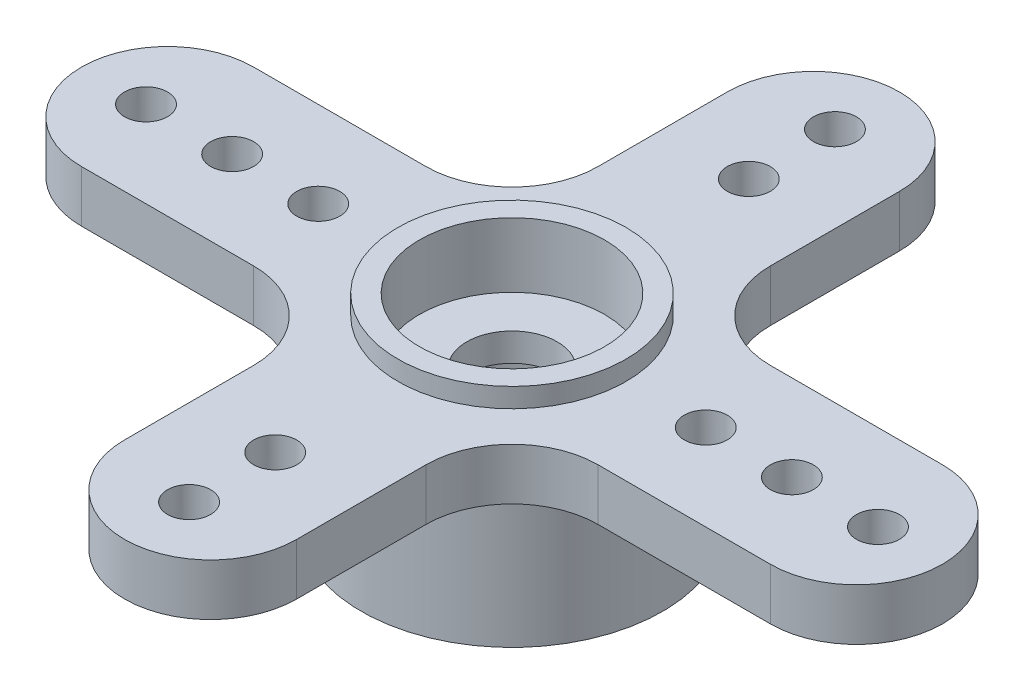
ISO-10303-21;
HEADER;
FILE_DESCRIPTION(('STEP AP214'),'2;1');
FILE_NAME('part.step','',(''),(''),'','','');
FILE_SCHEMA(('AUTOMOTIVE_DESIGN { 1 0 10303 214 1 1 1 1 }'));
ENDSEC;
DATA;
#1=APPLICATION_CONTEXT('core data for automotive mechanical design processes');
#2=APPLICATION_PROTOCOL_DEFINITION('international standard','automotive_design',2000,#1);
#3=PRODUCT_CONTEXT('',#1,'mechanical');
#4=PRODUCT('Part','Part','',(#3));
#5=PRODUCT_RELATED_PRODUCT_CATEGORY('part','',(#4));
#6=PRODUCT_DEFINITION_FORMATION('','',#4);
#7=PRODUCT_DEFINITION_CONTEXT('part definition',#1,'design');
#8=PRODUCT_DEFINITION('design','',#6,#7);
#9=PRODUCT_DEFINITION_SHAPE('','',#8);
#10=(LENGTH_UNIT() NAMED_UNIT(*) SI_UNIT(.MILLI.,.METRE.));
#11=(NAMED_UNIT(*) PLANE_ANGLE_UNIT() SI_UNIT($,.RADIAN.));
#12=(NAMED_UNIT(*) SI_UNIT($,.STERADIAN.) SOLID_ANGLE_UNIT());
#13=UNCERTAINTY_MEASURE_WITH_UNIT(LENGTH_MEASURE(1.E-05),#10,'distance_accuracy_value','');
#14=(GEOMETRIC_REPRESENTATION_CONTEXT(3) GLOBAL_UNCERTAINTY_ASSIGNED_CONTEXT((#13)) GLOBAL_UNIT_ASSIGNED_CONTEXT((#10,
#11,#12)) REPRESENTATION_CONTEXT('',''));
#15=CARTESIAN_POINT('',(0.,0.,0.));
#16=DIRECTION('',(0.,0.,1.));
#17=DIRECTION('',(1.,0.,0.));
#18=AXIS2_PLACEMENT_3D('',#15,#16,#17);
#19=CARTESIAN_POINT('',(3.5,0.500000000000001,0.));
#20=DIRECTION('',(0.,-1.,0.));
#21=DIRECTION('',(0.,0.,-1.));
#22=AXIS2_PLACEMENT_3D('',#19,#20,#21);
#23=PLANE('',#22);
#24=CARTESIAN_POINT('',(0.,0.5,0.));
#25=DIRECTION('',(0.,-1.,0.));
#26=DIRECTION('',(0.,0.,-1.));
#27=AXIS2_PLACEMENT_3D('',#24,#25,#26);
#28=CIRCLE('',#27,3.5);
#29=CARTESIAN_POINT('',(0.,0.5,-3.5));
#30=VERTEX_POINT('',#29);
#31=EDGE_CURVE('E205',#30,#30,#28,.T.);
#32=ORIENTED_EDGE('',*,*,#31,.F.);
#33=EDGE_LOOP('',(#32));
#34=FACE_BOUND('',#33,.T.);
#35=CARTESIAN_POINT('',(-6.5,0.500000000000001,0.));
#36=DIRECTION('',(0.,-1.,0.));
#37=DIRECTION('',(0.,0.,-1.));
#38=AXIS2_PLACEMENT_3D('',#35,#36,#37);
#39=CIRCLE('',#38,0.499999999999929);
#40=CARTESIAN_POINT('',(-6.5,0.500000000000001,-0.499999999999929));
#41=VERTEX_POINT('',#40);
#42=EDGE_CURVE('E229',#41,#41,#39,.T.);
#43=ORIENTED_EDGE('',*,*,#42,.F.);
#44=EDGE_LOOP('',(#43));
#45=FACE_BOUND('',#44,.T.);
#46=CARTESIAN_POINT('',(-4.5,0.500000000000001,0.));
#47=DIRECTION('',(0.,-1.,0.));
#48=DIRECTION('',(0.,0.,-1.));
#49=AXIS2_PLACEMENT_3D('',#46,#47,#48);
#50=CIRCLE('',#49,0.499999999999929);
#51=CARTESIAN_POINT('',(-4.5,0.500000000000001,-0.499999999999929));
#52=VERTEX_POINT('',#51);
#53=EDGE_CURVE('E235',#52,#52,#50,.T.);
#54=ORIENTED_EDGE('',*,*,#53,.F.);
#55=EDGE_LOOP('',(#54));
#56=FACE_BOUND('',#55,.T.);
#57=CARTESIAN_POINT('',(-8.5,0.500000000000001,0.));
#58=DIRECTION('',(0.,-1.,0.));
#59=DIRECTION('',(0.,0.,-1.));
#60=AXIS2_PLACEMENT_3D('',#57,#58,#59);
#61=CIRCLE('',#60,0.499999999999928);
#62=CARTESIAN_POINT('',(-8.5,0.500000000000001,-0.499999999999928));
#63=VERTEX_POINT('',#62);
#64=EDGE_CURVE('E241',#63,#63,#61,.T.);
#65=ORIENTED_EDGE('',*,*,#64,.F.);
#66=EDGE_LOOP('',(#65));
#67=FACE_BOUND('',#66,.T.);
#68=CARTESIAN_POINT('',(6.5,0.500000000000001,0.));
#69=DIRECTION('',(0.,-1.,0.));
#70=DIRECTION('',(0.,0.,-1.));
#71=AXIS2_PLACEMENT_3D('',#68,#69,#70);
#72=CIRCLE('',#71,0.499999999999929);
#73=CARTESIAN_POINT('',(6.5,0.500000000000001,-0.499999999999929));
#74=VERTEX_POINT('',#73);
#75=EDGE_CURVE('E247',#74,#74,#72,.T.);
#76=ORIENTED_EDGE('',*,*,#75,.F.);
#77=EDGE_LOOP('',(#76));
#78=FACE_BOUND('',#77,.T.);
#79=CARTESIAN_POINT('',(4.5,0.500000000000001,0.));
#80=DIRECTION('',(0.,-1.,0.));
#81=DIRECTION('',(0.,0.,-1.));
#82=AXIS2_PLACEMENT_3D('',#79,#80,#81);
#83=CIRCLE('',#82,0.499999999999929);
#84=CARTESIAN_POINT('',(4.5,0.500000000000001,-0.499999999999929));
#85=VERTEX_POINT('',#84);
#86=EDGE_CURVE('E253',#85,#85,#83,.T.);
#87=ORIENTED_EDGE('',*,*,#86,.F.);
#88=EDGE_LOOP('',(#87));
#89=FACE_BOUND('',#88,.T.);
#90=CARTESIAN_POINT('',(8.5,0.500000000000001,0.));
#91=DIRECTION('',(0.,-1.,0.));
#92=DIRECTION('',(0.,0.,-1.));
#93=AXIS2_PLACEMENT_3D('',#90,#91,#92);
#94=CIRCLE('',#93,0.499999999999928);
#95=CARTESIAN_POINT('',(8.5,0.500000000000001,-0.499999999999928));
#96=VERTEX_POINT('',#95);
#97=EDGE_CURVE('E259',#96,#96,#94,.T.);
#98=ORIENTED_EDGE('',*,*,#97,.F.);
#99=EDGE_LOOP('',(#98));
#100=FACE_BOUND('',#99,.T.);
#101=CARTESIAN_POINT('',(0.,0.500000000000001,-7.5));
#102=DIRECTION('',(0.,-1.,0.));
#103=DIRECTION('',(0.,0.,-1.));
#104=AXIS2_PLACEMENT_3D('',#101,#102,#103);
#105=CIRCLE('',#104,0.499999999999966);
#106=CARTESIAN_POINT('',(0.,0.500000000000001,-7.99999999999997));
#107=VERTEX_POINT('',#106);
#108=EDGE_CURVE('E265',#107,#107,#105,.T.);
#109=ORIENTED_EDGE('',*,*,#108,.F.);
#110=EDGE_LOOP('',(#109));
#111=FACE_BOUND('',#110,.T.);
#112=CARTESIAN_POINT('',(0.,0.500000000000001,-5.5));
#113=DIRECTION('',(0.,-1.,0.));
#114=DIRECTION('',(0.,0.,-1.));
#115=AXIS2_PLACEMENT_3D('',#112,#113,#114);
#116=CIRCLE('',#115,0.499999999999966);
#117=CARTESIAN_POINT('',(0.,0.500000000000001,-5.99999999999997));
#118=VERTEX_POINT('',#117);
#119=EDGE_CURVE('E271',#118,#118,#116,.T.);
#120=ORIENTED_EDGE('',*,*,#119,.F.);
#121=EDGE_LOOP('',(#120));
#122=FACE_BOUND('',#121,.T.);
#123=CARTESIAN_POINT('',(0.,0.500000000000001,7.5));
#124=DIRECTION('',(0.,-1.,0.));
#125=DIRECTION('',(0.,0.,-1.));
#126=AXIS2_PLACEMENT_3D('',#123,#124,#125);
#127=CIRCLE('',#126,0.499999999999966);
#128=CARTESIAN_POINT('',(0.,0.500000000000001,7.00000000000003));
#129=VERTEX_POINT('',#128);
#130=EDGE_CURVE('E277',#129,#129,#127,.T.);
#131=ORIENTED_EDGE('',*,*,#130,.F.);
#132=EDGE_LOOP('',(#131));
#133=FACE_BOUND('',#132,.T.);
#134=CARTESIAN_POINT('',(0.,0.500000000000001,5.5));
#135=DIRECTION('',(0.,-1.,0.));
#136=DIRECTION('',(0.,0.,-1.));
#137=AXIS2_PLACEMENT_3D('',#134,#135,#136);
#138=CIRCLE('',#137,0.499999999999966);
#139=CARTESIAN_POINT('',(0.,0.500000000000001,5.00000000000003));
#140=VERTEX_POINT('',#139);
#141=EDGE_CURVE('E283',#140,#140,#138,.T.);
#142=ORIENTED_EDGE('',*,*,#141,.F.);
#143=EDGE_LOOP('',(#142));
#144=FACE_BOUND('',#143,.T.);
#145=DIRECTION('',(-1.,0.,0.));
#146=VECTOR('',#145,1.);
#147=CARTESIAN_POINT('',(3.5,0.500000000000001,2.));
#148=LINE('',#147,#146);
#149=CARTESIAN_POINT('',(8.,0.5,2.));
#150=VERTEX_POINT('',#149);
#151=CARTESIAN_POINT('',(4.,0.500000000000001,2.));
#152=VERTEX_POINT('',#151);
#153=EDGE_CURVE('E332',#150,#152,#148,.T.);
#154=ORIENTED_EDGE('',*,*,#153,.T.);
#155=CARTESIAN_POINT('',(4.,0.5,4.));
#156=DIRECTION('',(0.,-1.,0.));
#157=DIRECTION('',(0.,0.,-1.));
#158=AXIS2_PLACEMENT_3D('',#155,#156,#157);
#159=CIRCLE('',#158,2.);
#160=CARTESIAN_POINT('',(2.,0.5,4.));
#161=VERTEX_POINT('',#160);
#162=EDGE_CURVE('E154',#152,#161,#159,.F.);
#163=ORIENTED_EDGE('',*,*,#162,.T.);
#164=DIRECTION('',(0.,0.,1.));
#165=VECTOR('',#164,1.);
#166=CARTESIAN_POINT('',(2.,0.500000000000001,0.));
#167=LINE('',#166,#165);
#168=CARTESIAN_POINT('',(2.,0.5,7.));
#169=VERTEX_POINT('',#168);
#170=EDGE_CURVE('E290',#161,#169,#167,.T.);
#171=ORIENTED_EDGE('',*,*,#170,.T.);
#172=CARTESIAN_POINT('',(0.,0.5,7.));
#173=DIRECTION('',(0.,-1.,0.));
#174=DIRECTION('',(0.,0.,-1.));
#175=AXIS2_PLACEMENT_3D('',#172,#173,#174);
#176=CIRCLE('',#175,2.);
#177=CARTESIAN_POINT('',(-2.,0.5,7.));
#178=VERTEX_POINT('',#177);
#179=EDGE_CURVE('E293',#169,#178,#176,.T.);
#180=ORIENTED_EDGE('',*,*,#179,.T.);
#181=DIRECTION('',(0.,0.,-1.));
#182=VECTOR('',#181,1.);
#183=CARTESIAN_POINT('',(-2.,0.500000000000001,0.));
#184=LINE('',#183,#182);
#185=CARTESIAN_POINT('',(-2.,0.5,4.));
#186=VERTEX_POINT('',#185);
#187=EDGE_CURVE('E296',#178,#186,#184,.T.);
#188=ORIENTED_EDGE('',*,*,#187,.T.);
#189=CARTESIAN_POINT('',(-4.,0.5,4.));
#190=DIRECTION('',(0.,-1.,0.));
#191=DIRECTION('',(0.,0.,-1.));
#192=AXIS2_PLACEMENT_3D('',#189,#190,#191);
#193=CIRCLE('',#192,2.);
#194=CARTESIAN_POINT('',(-4.,0.5,2.));
#195=VERTEX_POINT('',#194);
#196=EDGE_CURVE('E299',#186,#195,#193,.F.);
#197=ORIENTED_EDGE('',*,*,#196,.T.);
#198=DIRECTION('',(-1.,0.,0.));
#199=VECTOR('',#198,1.);
#200=CARTESIAN_POINT('',(3.5,0.500000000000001,2.));
#201=LINE('',#200,#199);
#202=CARTESIAN_POINT('',(-8.,0.5,2.));
#203=VERTEX_POINT('',#202);
#204=EDGE_CURVE('E302',#195,#203,#201,.T.);
#205=ORIENTED_EDGE('',*,*,#204,.T.);
#206=CARTESIAN_POINT('',(-8.,0.5,0.));
#207=DIRECTION('',(0.,-1.,0.));
#208=DIRECTION('',(0.,0.,-1.));
#209=AXIS2_PLACEMENT_3D('',#206,#207,#208);
#210=CIRCLE('',#209,2.);
#211=CARTESIAN_POINT('',(-8.,0.5,-2.));
#212=VERTEX_POINT('',#211);
#213=EDGE_CURVE('E305',#203,#212,#210,.T.);
#214=ORIENTED_EDGE('',*,*,#213,.T.);
#215=DIRECTION('',(1.,0.,0.));
#216=VECTOR('',#215,1.);
#217=CARTESIAN_POINT('',(3.5,0.500000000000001,-2.));
#218=LINE('',#217,#216);
#219=CARTESIAN_POINT('',(-4.,0.5,-2.));
#220=VERTEX_POINT('',#219);
#221=EDGE_CURVE('E308',#212,#220,#218,.T.);
#222=ORIENTED_EDGE('',*,*,#221,.T.);
#223=CARTESIAN_POINT('',(-4.,0.5,-4.));
#224=DIRECTION('',(0.,-1.,0.));
#225=DIRECTION('',(0.,0.,-1.));
#226=AXIS2_PLACEMENT_3D('',#223,#224,#225);
#227=CIRCLE('',#226,2.);
#228=CARTESIAN_POINT('',(-2.,0.5,-4.));
#229=VERTEX_POINT('',#228);
#230=EDGE_CURVE('E311',#220,#229,#227,.F.);
#231=ORIENTED_EDGE('',*,*,#230,.T.);
#232=DIRECTION('',(0.,0.,-1.));
#233=VECTOR('',#232,1.);
#234=CARTESIAN_POINT('',(-2.,0.500000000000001,0.));
#235=LINE('',#234,#233);
#236=CARTESIAN_POINT('',(-2.,0.5,-7.));
#237=VERTEX_POINT('',#236);
#238=EDGE_CURVE('E314',#229,#237,#235,.T.);
#239=ORIENTED_EDGE('',*,*,#238,.T.);
#240=CARTESIAN_POINT('',(0.,0.5,-7.));
#241=DIRECTION('',(0.,-1.,0.));
#242=DIRECTION('',(0.,0.,-1.));
#243=AXIS2_PLACEMENT_3D('',#240,#241,#242);
#244=CIRCLE('',#243,2.);
#245=CARTESIAN_POINT('',(2.,0.5,-7.));
#246=VERTEX_POINT('',#245);
#247=EDGE_CURVE('E317',#237,#246,#244,.T.);
#248=ORIENTED_EDGE('',*,*,#247,.T.);
#249=DIRECTION('',(0.,0.,1.));
#250=VECTOR('',#249,1.);
#251=CARTESIAN_POINT('',(2.,0.500000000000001,0.));
#252=LINE('',#251,#250);
#253=CARTESIAN_POINT('',(2.,0.5,-4.));
#254=VERTEX_POINT('',#253);
#255=EDGE_CURVE('E320',#246,#254,#252,.T.);
#256=ORIENTED_EDGE('',*,*,#255,.T.);
#257=CARTESIAN_POINT('',(4.,0.5,-4.));
#258=DIRECTION('',(0.,-1.,0.));
#259=DIRECTION('',(0.,0.,-1.));
#260=AXIS2_PLACEMENT_3D('',#257,#258,#259);
#261=CIRCLE('',#260,2.);
#262=CARTESIAN_POINT('',(4.,0.5,-2.));
#263=VERTEX_POINT('',#262);
#264=EDGE_CURVE('E323',#254,#263,#261,.F.);
#265=ORIENTED_EDGE('',*,*,#264,.T.);
#266=DIRECTION('',(1.,0.,0.));
#267=VECTOR('',#266,1.);
#268=CARTESIAN_POINT('',(3.5,0.500000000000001,-2.));
#269=LINE('',#268,#267);
#270=CARTESIAN_POINT('',(8.,0.5,-2.));
#271=VERTEX_POINT('',#270);
#272=EDGE_CURVE('E326',#263,#271,#269,.T.);
#273=ORIENTED_EDGE('',*,*,#272,.T.);
#274=CARTESIAN_POINT('',(8.,0.5,0.));
#275=DIRECTION('',(0.,-1.,0.));
#276=DIRECTION('',(0.,0.,-1.));
#277=AXIS2_PLACEMENT_3D('',#274,#275,#276);
#278=CIRCLE('',#277,2.);
#279=EDGE_CURVE('E329',#271,#150,#278,.T.);
#280=ORIENTED_EDGE('',*,*,#279,.T.);
#281=EDGE_LOOP('',(#154,#163,#171,#180,#188,#197,#205,#214,#222,#231,#239,#248,#256,#265,#273,#280));
#282=FACE_BOUND('',#281,.T.);
#283=ADVANCED_FACE('F32',(#34,#45,#56,#67,#78,#89,#100,#111,#122,#133,#144,#282),#23,.T.);
#284=CARTESIAN_POINT('',(25.,1.7,0.));
#285=DIRECTION('',(0.,1.,0.));
#286=DIRECTION('',(0.,0.,1.));
#287=AXIS2_PLACEMENT_3D('',#284,#285,#286);
#288=PLANE('',#287);
#289=CARTESIAN_POINT('',(0.,1.7,0.));
#290=DIRECTION('',(0.,-1.,0.));
#291=DIRECTION('',(0.,0.,-1.));
#292=AXIS2_PLACEMENT_3D('',#289,#290,#291);
#293=CIRCLE('',#292,2.65);
#294=CARTESIAN_POINT('',(0.,1.7,-2.65));
#295=VERTEX_POINT('',#294);
#296=EDGE_CURVE('E208',#295,#295,#293,.T.);
#297=ORIENTED_EDGE('',*,*,#296,.T.);
#298=EDGE_LOOP('',(#297));
#299=FACE_BOUND('',#298,.T.);
#300=CARTESIAN_POINT('',(-6.5,1.7,0.));
#301=DIRECTION('',(0.,1.,0.));
#302=DIRECTION('',(0.,0.,1.));
#303=AXIS2_PLACEMENT_3D('',#300,#301,#302);
#304=CIRCLE('',#303,0.499999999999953);
#305=CARTESIAN_POINT('',(-6.5,1.7,0.499999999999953));
#306=VERTEX_POINT('',#305);
#307=EDGE_CURVE('E232',#306,#306,#304,.T.);
#308=ORIENTED_EDGE('',*,*,#307,.F.);
#309=EDGE_LOOP('',(#308));
#310=FACE_BOUND('',#309,.T.);
#311=CARTESIAN_POINT('',(-4.5,1.7,0.));
#312=DIRECTION('',(0.,1.,0.));
#313=DIRECTION('',(0.,0.,1.));
#314=AXIS2_PLACEMENT_3D('',#311,#312,#313);
#315=CIRCLE('',#314,0.499999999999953);
#316=CARTESIAN_POINT('',(-4.5,1.7,0.499999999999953));
#317=VERTEX_POINT('',#316);
#318=EDGE_CURVE('E238',#317,#317,#315,.T.);
#319=ORIENTED_EDGE('',*,*,#318,.F.);
#320=EDGE_LOOP('',(#319));
#321=FACE_BOUND('',#320,.T.);
#322=CARTESIAN_POINT('',(-8.5,1.7,0.));
#323=DIRECTION('',(0.,1.,0.));
#324=DIRECTION('',(0.,0.,1.));
#325=AXIS2_PLACEMENT_3D('',#322,#323,#324);
#326=CIRCLE('',#325,0.499999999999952);
#327=CARTESIAN_POINT('',(-8.5,1.7,0.499999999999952));
#328=VERTEX_POINT('',#327);
#329=EDGE_CURVE('E244',#328,#328,#326,.T.);
#330=ORIENTED_EDGE('',*,*,#329,.F.);
#331=EDGE_LOOP('',(#330));
#332=FACE_BOUND('',#331,.T.);
#333=CARTESIAN_POINT('',(6.5,1.7,0.));
#334=DIRECTION('',(0.,1.,0.));
#335=DIRECTION('',(0.,0.,1.));
#336=AXIS2_PLACEMENT_3D('',#333,#334,#335);
#337=CIRCLE('',#336,0.499999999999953);
#338=CARTESIAN_POINT('',(6.5,1.7,0.499999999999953));
#339=VERTEX_POINT('',#338);
#340=EDGE_CURVE('E250',#339,#339,#337,.T.);
#341=ORIENTED_EDGE('',*,*,#340,.F.);
#342=EDGE_LOOP('',(#341));
#343=FACE_BOUND('',#342,.T.);
#344=CARTESIAN_POINT('',(4.5,1.7,0.));
#345=DIRECTION('',(0.,1.,0.));
#346=DIRECTION('',(0.,0.,1.));
#347=AXIS2_PLACEMENT_3D('',#344,#345,#346);
#348=CIRCLE('',#347,0.499999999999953);
#349=CARTESIAN_POINT('',(4.5,1.7,0.499999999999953));
#350=VERTEX_POINT('',#349);
#351=EDGE_CURVE('E256',#350,#350,#348,.T.);
#352=ORIENTED_EDGE('',*,*,#351,.F.);
#353=EDGE_LOOP('',(#352));
#354=FACE_BOUND('',#353,.T.);
#355=CARTESIAN_POINT('',(8.5,1.7,0.));
#356=DIRECTION('',(0.,1.,0.));
#357=DIRECTION('',(0.,0.,1.));
#358=AXIS2_PLACEMENT_3D('',#355,#356,#357);
#359=CIRCLE('',#358,0.499999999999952);
#360=CARTESIAN_POINT('',(8.5,1.7,0.499999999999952));
#361=VERTEX_POINT('',#360);
#362=EDGE_CURVE('E262',#361,#361,#359,.T.);
#363=ORIENTED_EDGE('',*,*,#362,.F.);
#364=EDGE_LOOP('',(#363));
#365=FACE_BOUND('',#364,.T.);
#366=CARTESIAN_POINT('',(0.,1.7,-7.5));
#367=DIRECTION('',(0.,1.,0.));
#368=DIRECTION('',(0.,0.,1.));
#369=AXIS2_PLACEMENT_3D('',#366,#367,#368);
#370=CIRCLE('',#369,0.49999999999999);
#371=CARTESIAN_POINT('',(0.,1.7,-7.00000000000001));
#372=VERTEX_POINT('',#371);
#373=EDGE_CURVE('E268',#372,#372,#370,.T.);
#374=ORIENTED_EDGE('',*,*,#373,.F.);
#375=EDGE_LOOP('',(#374));
#376=FACE_BOUND('',#375,.T.);
#377=CARTESIAN_POINT('',(0.,1.7,-5.5));
#378=DIRECTION('',(0.,1.,0.));
#379=DIRECTION('',(0.,0.,1.));
#380=AXIS2_PLACEMENT_3D('',#377,#378,#379);
#381=CIRCLE('',#380,0.49999999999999);
#382=CARTESIAN_POINT('',(0.,1.7,-5.00000000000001));
#383=VERTEX_POINT('',#382);
#384=EDGE_CURVE('E274',#383,#383,#381,.T.);
#385=ORIENTED_EDGE('',*,*,#384,.F.);
#386=EDGE_LOOP('',(#385));
#387=FACE_BOUND('',#386,.T.);
#388=CARTESIAN_POINT('',(0.,1.7,7.5));
#389=DIRECTION('',(0.,1.,0.));
#390=DIRECTION('',(0.,0.,1.));
#391=AXIS2_PLACEMENT_3D('',#388,#389,#390);
#392=CIRCLE('',#391,0.49999999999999);
#393=CARTESIAN_POINT('',(0.,1.7,7.99999999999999));
#394=VERTEX_POINT('',#393);
#395=EDGE_CURVE('E280',#394,#394,#392,.T.);
#396=ORIENTED_EDGE('',*,*,#395,.F.);
#397=EDGE_LOOP('',(#396));
#398=FACE_BOUND('',#397,.T.);
#399=CARTESIAN_POINT('',(0.,1.7,5.5));
#400=DIRECTION('',(0.,1.,0.));
#401=DIRECTION('',(0.,0.,1.));
#402=AXIS2_PLACEMENT_3D('',#399,#400,#401);
#403=CIRCLE('',#402,0.49999999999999);
#404=CARTESIAN_POINT('',(0.,1.7,5.99999999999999));
#405=VERTEX_POINT('',#404);
#406=EDGE_CURVE('E286',#405,#405,#403,.T.);
#407=ORIENTED_EDGE('',*,*,#406,.F.);
#408=EDGE_LOOP('',(#407));
#409=FACE_BOUND('',#408,.T.);
#410=DIRECTION('',(0.,0.,-1.));
#411=VECTOR('',#410,1.);
#412=CARTESIAN_POINT('',(2.,1.7,0.));
#413=LINE('',#412,#411);
#414=CARTESIAN_POINT('',(2.,1.7,7.));
#415=VERTEX_POINT('',#414);
#416=CARTESIAN_POINT('',(2.,1.7,4.));
#417=VERTEX_POINT('',#416);
#418=EDGE_CURVE('E40',#415,#417,#413,.T.);
#419=ORIENTED_EDGE('',*,*,#418,.T.);
#420=CARTESIAN_POINT('',(4.,1.7,4.));
#421=DIRECTION('',(0.,1.,0.));
#422=DIRECTION('',(0.,0.,1.));
#423=AXIS2_PLACEMENT_3D('',#420,#421,#422);
#424=CIRCLE('',#423,2.);
#425=CARTESIAN_POINT('',(4.,1.7,2.));
#426=VERTEX_POINT('',#425);
#427=EDGE_CURVE('E12',#417,#426,#424,.F.);
#428=ORIENTED_EDGE('',*,*,#427,.T.);
#429=DIRECTION('',(1.,0.,0.));
#430=VECTOR('',#429,1.);
#431=CARTESIAN_POINT('',(25.,1.7,2.00000000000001));
#432=LINE('',#431,#430);
#433=CARTESIAN_POINT('',(8.,1.7,2.));
#434=VERTEX_POINT('',#433);
#435=EDGE_CURVE('E142',#426,#434,#432,.T.);
#436=ORIENTED_EDGE('',*,*,#435,.T.);
#437=CARTESIAN_POINT('',(8.,1.7,0.));
#438=DIRECTION('',(0.,1.,0.));
#439=DIRECTION('',(0.,0.,1.));
#440=AXIS2_PLACEMENT_3D('',#437,#438,#439);
#441=CIRCLE('',#440,2.);
#442=CARTESIAN_POINT('',(8.,1.7,-2.));
#443=VERTEX_POINT('',#442);
#444=EDGE_CURVE('E146',#434,#443,#441,.T.);
#445=ORIENTED_EDGE('',*,*,#444,.T.);
#446=DIRECTION('',(-1.,0.,0.));
#447=VECTOR('',#446,1.);
#448=CARTESIAN_POINT('',(25.,1.7,-2.00000000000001));
#449=LINE('',#448,#447);
#450=CARTESIAN_POINT('',(4.,1.7,-2.));
#451=VERTEX_POINT('',#450);
#452=EDGE_CURVE('E196',#443,#451,#449,.T.);
#453=ORIENTED_EDGE('',*,*,#452,.T.);
#454=CARTESIAN_POINT('',(4.,1.7,-4.));
#455=DIRECTION('',(0.,1.,0.));
#456=DIRECTION('',(0.,0.,1.));
#457=AXIS2_PLACEMENT_3D('',#454,#455,#456);
#458=CIRCLE('',#457,2.);
#459=CARTESIAN_POINT('',(2.,1.7,-4.));
#460=VERTEX_POINT('',#459);
#461=EDGE_CURVE('E193',#451,#460,#458,.F.);
#462=ORIENTED_EDGE('',*,*,#461,.T.);
#463=DIRECTION('',(0.,0.,-1.));
#464=VECTOR('',#463,1.);
#465=CARTESIAN_POINT('',(2.,1.7,0.));
#466=LINE('',#465,#464);
#467=CARTESIAN_POINT('',(2.,1.7,-7.));
#468=VERTEX_POINT('',#467);
#469=EDGE_CURVE('E190',#460,#468,#466,.T.);
#470=ORIENTED_EDGE('',*,*,#469,.T.);
#471=CARTESIAN_POINT('',(0.,1.7,-7.));
#472=DIRECTION('',(0.,1.,0.));
#473=DIRECTION('',(0.,0.,1.));
#474=AXIS2_PLACEMENT_3D('',#471,#472,#473);
#475=CIRCLE('',#474,2.);
#476=CARTESIAN_POINT('',(-2.,1.7,-7.));
#477=VERTEX_POINT('',#476);
#478=EDGE_CURVE('E187',#468,#477,#475,.T.);
#479=ORIENTED_EDGE('',*,*,#478,.T.);
#480=DIRECTION('',(0.,0.,1.));
#481=VECTOR('',#480,1.);
#482=CARTESIAN_POINT('',(-2.,1.7,0.));
#483=LINE('',#482,#481);
#484=CARTESIAN_POINT('',(-2.,1.7,-4.));
#485=VERTEX_POINT('',#484);
#486=EDGE_CURVE('E184',#477,#485,#483,.T.);
#487=ORIENTED_EDGE('',*,*,#486,.T.);
#488=CARTESIAN_POINT('',(-4.,1.7,-4.));
#489=DIRECTION('',(0.,1.,0.));
#490=DIRECTION('',(0.,0.,1.));
#491=AXIS2_PLACEMENT_3D('',#488,#489,#490);
#492=CIRCLE('',#491,2.);
#493=CARTESIAN_POINT('',(-4.,1.7,-2.));
#494=VERTEX_POINT('',#493);
#495=EDGE_CURVE('E181',#485,#494,#492,.F.);
#496=ORIENTED_EDGE('',*,*,#495,.T.);
#497=DIRECTION('',(-1.,0.,0.));
#498=VECTOR('',#497,1.);
#499=CARTESIAN_POINT('',(25.,1.7,-2.));
#500=LINE('',#499,#498);
#501=CARTESIAN_POINT('',(-8.,1.7,-2.));
#502=VERTEX_POINT('',#501);
#503=EDGE_CURVE('E178',#494,#502,#500,.T.);
#504=ORIENTED_EDGE('',*,*,#503,.T.);
#505=CARTESIAN_POINT('',(-8.,1.7,0.));
#506=DIRECTION('',(0.,1.,0.));
#507=DIRECTION('',(0.,0.,1.));
#508=AXIS2_PLACEMENT_3D('',#505,#506,#507);
#509=CIRCLE('',#508,2.);
#510=CARTESIAN_POINT('',(-8.,1.7,2.));
#511=VERTEX_POINT('',#510);
#512=EDGE_CURVE('E175',#502,#511,#509,.T.);
#513=ORIENTED_EDGE('',*,*,#512,.T.);
#514=DIRECTION('',(1.,0.,0.));
#515=VECTOR('',#514,1.);
#516=CARTESIAN_POINT('',(25.,1.7,2.));
#517=LINE('',#516,#515);
#518=CARTESIAN_POINT('',(-4.,1.7,2.));
#519=VERTEX_POINT('',#518);
#520=EDGE_CURVE('E172',#511,#519,#517,.T.);
#521=ORIENTED_EDGE('',*,*,#520,.T.);
#522=CARTESIAN_POINT('',(-4.,1.7,4.));
#523=DIRECTION('',(0.,1.,0.));
#524=DIRECTION('',(0.,0.,1.));
#525=AXIS2_PLACEMENT_3D('',#522,#523,#524);
#526=CIRCLE('',#525,2.);
#527=CARTESIAN_POINT('',(-2.,1.7,4.));
#528=VERTEX_POINT('',#527);
#529=EDGE_CURVE('E169',#519,#528,#526,.F.);
#530=ORIENTED_EDGE('',*,*,#529,.T.);
#531=DIRECTION('',(0.,0.,1.));
#532=VECTOR('',#531,1.);
#533=CARTESIAN_POINT('',(-2.,1.7,0.));
#534=LINE('',#533,#532);
#535=CARTESIAN_POINT('',(-2.,1.7,7.));
#536=VERTEX_POINT('',#535);
#537=EDGE_CURVE('E165',#528,#536,#534,.T.);
#538=ORIENTED_EDGE('',*,*,#537,.T.);
#539=CARTESIAN_POINT('',(0.,1.7,7.));
#540=DIRECTION('',(0.,1.,0.));
#541=DIRECTION('',(0.,0.,1.));
#542=AXIS2_PLACEMENT_3D('',#539,#540,#541);
#543=CIRCLE('',#542,2.);
#544=EDGE_CURVE('E161',#536,#415,#543,.T.);
#545=ORIENTED_EDGE('',*,*,#544,.T.);
#546=EDGE_LOOP('',(#419,#428,#436,#445,#453,#462,#470,#479,#487,#496,#504,#513,#521,#530,#538,#545));
#547=FACE_BOUND('',#546,.T.);
#548=ADVANCED_FACE('F158',(#299,#310,#321,#332,#343,#354,#365,#376,#387,#398,#409,#547),#288,.T.);
#549=CARTESIAN_POINT('',(0.,-19.4580401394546,0.));
#550=DIRECTION('',(0.,-1.,0.));
#551=DIRECTION('',(0.,0.,-1.));
#552=AXIS2_PLACEMENT_3D('',#549,#550,#551);
#553=CYLINDRICAL_SURFACE('',#552,2.25);
#554=CARTESIAN_POINT('',(0.,-2.5,0.));
#555=DIRECTION('',(0.,-1.,0.));
#556=DIRECTION('',(0.,0.,-1.));
#557=AXIS2_PLACEMENT_3D('',#554,#555,#556);
#558=CIRCLE('',#557,2.25);
#559=CARTESIAN_POINT('',(0.,-2.5,-2.25));
#560=VERTEX_POINT('',#559);
#561=EDGE_CURVE('E147',#560,#560,#558,.T.);
#562=ORIENTED_EDGE('',*,*,#561,.T.);
#563=EDGE_LOOP('',(#562));
#564=FACE_BOUND('',#563,.T.);
#565=CARTESIAN_POINT('',(0.,0.,0.));
#566=DIRECTION('',(0.,-1.,0.));
#567=DIRECTION('',(0.,0.,-1.));
#568=AXIS2_PLACEMENT_3D('',#565,#566,#567);
#569=CIRCLE('',#568,2.25);
#570=CARTESIAN_POINT('',(0.,0.,-2.25));
#571=VERTEX_POINT('',#570);
#572=EDGE_CURVE('E226',#571,#571,#569,.T.);
#573=ORIENTED_EDGE('',*,*,#572,.F.);
#574=EDGE_LOOP('',(#573));
#575=FACE_BOUND('',#574,.T.);
#576=ADVANCED_FACE('F34',(#564,#575),#553,.F.);
#577=CARTESIAN_POINT('',(2.25,-2.5,0.));
#578=DIRECTION('',(0.,-1.,0.));
#579=DIRECTION('',(0.,0.,-1.));
#580=AXIS2_PLACEMENT_3D('',#577,#578,#579);
#581=PLANE('',#580);
#582=CARTESIAN_POINT('',(0.,-2.5,0.));
#583=DIRECTION('',(0.,-1.,0.));
#584=DIRECTION('',(0.,0.,-1.));
#585=AXIS2_PLACEMENT_3D('',#582,#583,#584);
#586=CIRCLE('',#585,3.5);
#587=CARTESIAN_POINT('',(0.,-2.5,-3.5));
#588=VERTEX_POINT('',#587);
#589=EDGE_CURVE('E202',#588,#588,#586,.T.);
#590=ORIENTED_EDGE('',*,*,#589,.T.);
#591=EDGE_LOOP('',(#590));
#592=FACE_BOUND('',#591,.T.);
#593=ORIENTED_EDGE('',*,*,#561,.F.);
#594=EDGE_LOOP('',(#593));
#595=FACE_BOUND('',#594,.T.);
#596=ADVANCED_FACE('F437',(#592,#595),#581,.T.);
#597=CARTESIAN_POINT('',(0.,-19.4580401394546,0.));
#598=DIRECTION('',(0.,-1.,0.));
#599=DIRECTION('',(0.,0.,-1.));
#600=AXIS2_PLACEMENT_3D('',#597,#598,#599);
#601=CYLINDRICAL_SURFACE('',#600,3.5);
#602=ORIENTED_EDGE('',*,*,#31,.T.);
#603=EDGE_LOOP('',(#602));
#604=FACE_BOUND('',#603,.T.);
#605=ORIENTED_EDGE('',*,*,#589,.F.);
#606=EDGE_LOOP('',(#605));
#607=FACE_BOUND('',#606,.T.);
#608=ADVANCED_FACE('F434',(#604,#607),#601,.T.);
#609=CARTESIAN_POINT('',(0.,-19.4580401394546,0.));
#610=DIRECTION('',(0.,-1.,0.));
#611=DIRECTION('',(0.,0.,-1.));
#612=AXIS2_PLACEMENT_3D('',#609,#610,#611);
#613=CYLINDRICAL_SURFACE('',#612,2.65);
#614=CARTESIAN_POINT('',(0.,2.15,0.));
#615=DIRECTION('',(0.,-1.,0.));
#616=DIRECTION('',(0.,0.,-1.));
#617=AXIS2_PLACEMENT_3D('',#614,#615,#616);
#618=CIRCLE('',#617,2.65);
#619=CARTESIAN_POINT('',(0.,2.15,-2.65));
#620=VERTEX_POINT('',#619);
#621=EDGE_CURVE('E211',#620,#620,#618,.T.);
#622=ORIENTED_EDGE('',*,*,#621,.T.);
#623=EDGE_LOOP('',(#622));
#624=FACE_BOUND('',#623,.T.);
#625=ORIENTED_EDGE('',*,*,#296,.F.);
#626=EDGE_LOOP('',(#625));
#627=FACE_BOUND('',#626,.T.);
#628=ADVANCED_FACE('F436',(#624,#627),#613,.T.);
#629=CARTESIAN_POINT('',(2.65,2.15,0.));
#630=DIRECTION('',(0.,1.,0.));
#631=DIRECTION('',(0.,0.,1.));
#632=AXIS2_PLACEMENT_3D('',#629,#630,#631);
#633=PLANE('',#632);
#634=CARTESIAN_POINT('',(0.,2.15,0.));
#635=DIRECTION('',(0.,-1.,0.));
#636=DIRECTION('',(0.,0.,-1.));
#637=AXIS2_PLACEMENT_3D('',#634,#635,#636);
#638=CIRCLE('',#637,2.15);
#639=CARTESIAN_POINT('',(0.,2.15,-2.15));
#640=VERTEX_POINT('',#639);
#641=EDGE_CURVE('E214',#640,#640,#638,.T.);
#642=ORIENTED_EDGE('',*,*,#641,.T.);
#643=EDGE_LOOP('',(#642));
#644=FACE_BOUND('',#643,.T.);
#645=ORIENTED_EDGE('',*,*,#621,.F.);
#646=EDGE_LOOP('',(#645));
#647=FACE_BOUND('',#646,.T.);
#648=ADVANCED_FACE('F473',(#644,#647),#633,.T.);
#649=CARTESIAN_POINT('',(0.,-19.4580401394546,0.));
#650=DIRECTION('',(0.,-1.,0.));
#651=DIRECTION('',(0.,0.,-1.));
#652=AXIS2_PLACEMENT_3D('',#649,#650,#651);
#653=CYLINDRICAL_SURFACE('',#652,2.15);
#654=CARTESIAN_POINT('',(0.,0.649999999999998,0.));
#655=DIRECTION('',(0.,-1.,0.));
#656=DIRECTION('',(0.,0.,-1.));
#657=AXIS2_PLACEMENT_3D('',#654,#655,#656);
#658=CIRCLE('',#657,2.15);
#659=CARTESIAN_POINT('',(0.,0.649999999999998,-2.15));
#660=VERTEX_POINT('',#659);
#661=EDGE_CURVE('E217',#660,#660,#658,.T.);
#662=ORIENTED_EDGE('',*,*,#661,.T.);
#663=EDGE_LOOP('',(#662));
#664=FACE_BOUND('',#663,.T.);
#665=ORIENTED_EDGE('',*,*,#641,.F.);
#666=EDGE_LOOP('',(#665));
#667=FACE_BOUND('',#666,.T.);
#668=ADVANCED_FACE('F467',(#664,#667),#653,.F.);
#669=CARTESIAN_POINT('',(2.15,0.649999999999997,0.));
#670=DIRECTION('',(0.,1.,0.));
#671=DIRECTION('',(0.,0.,1.));
#672=AXIS2_PLACEMENT_3D('',#669,#670,#671);
#673=PLANE('',#672);
#674=CARTESIAN_POINT('',(0.,0.649999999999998,0.));
#675=DIRECTION('',(0.,-1.,0.));
#676=DIRECTION('',(0.,0.,-1.));
#677=AXIS2_PLACEMENT_3D('',#674,#675,#676);
#678=CIRCLE('',#677,1.05);
#679=CARTESIAN_POINT('',(0.,0.649999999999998,-1.05));
#680=VERTEX_POINT('',#679);
#681=EDGE_CURVE('E220',#680,#680,#678,.T.);
#682=ORIENTED_EDGE('',*,*,#681,.T.);
#683=EDGE_LOOP('',(#682));
#684=FACE_BOUND('',#683,.T.);
#685=ORIENTED_EDGE('',*,*,#661,.F.);
#686=EDGE_LOOP('',(#685));
#687=FACE_BOUND('',#686,.T.);
#688=ADVANCED_FACE('F461',(#684,#687),#673,.T.);
#689=CARTESIAN_POINT('',(0.,-19.4580401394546,0.));
#690=DIRECTION('',(0.,-1.,0.));
#691=DIRECTION('',(0.,0.,-1.));
#692=AXIS2_PLACEMENT_3D('',#689,#690,#691);
#693=CYLINDRICAL_SURFACE('',#692,1.05);
#694=CARTESIAN_POINT('',(0.,0.,0.));
#695=DIRECTION('',(0.,-1.,0.));
#696=DIRECTION('',(0.,0.,-1.));
#697=AXIS2_PLACEMENT_3D('',#694,#695,#696);
#698=CIRCLE('',#697,1.05);
#699=CARTESIAN_POINT('',(0.,0.,-1.05));
#700=VERTEX_POINT('',#699);
#701=EDGE_CURVE('E223',#700,#700,#698,.T.);
#702=ORIENTED_EDGE('',*,*,#701,.T.);
#703=EDGE_LOOP('',(#702));
#704=FACE_BOUND('',#703,.T.);
#705=ORIENTED_EDGE('',*,*,#681,.F.);
#706=EDGE_LOOP('',(#705));
#707=FACE_BOUND('',#706,.T.);
#708=ADVANCED_FACE('F455',(#704,#707),#693,.F.);
#709=CARTESIAN_POINT('',(1.05,0.,0.));
#710=DIRECTION('',(0.,-1.,0.));
#711=DIRECTION('',(0.,0.,-1.));
#712=AXIS2_PLACEMENT_3D('',#709,#710,#711);
#713=PLANE('',#712);
#714=ORIENTED_EDGE('',*,*,#572,.T.);
#715=EDGE_LOOP('',(#714));
#716=FACE_BOUND('',#715,.T.);
#717=ORIENTED_EDGE('',*,*,#701,.F.);
#718=EDGE_LOOP('',(#717));
#719=FACE_BOUND('',#718,.T.);
#720=ADVANCED_FACE('F451',(#716,#719),#713,.T.);
#721=CARTESIAN_POINT('',(-6.5,1.7,0.));
#722=DIRECTION('',(0.,1.,0.));
#723=DIRECTION('',(0.,0.,1.));
#724=AXIS2_PLACEMENT_3D('',#721,#722,#723);
#725=CYLINDRICAL_SURFACE('',#724,0.499999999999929);
#726=ORIENTED_EDGE('',*,*,#42,.T.);
#727=EDGE_LOOP('',(#726));
#728=FACE_BOUND('',#727,.T.);
#729=ORIENTED_EDGE('',*,*,#307,.T.);
#730=EDGE_LOOP('',(#729));
#731=FACE_BOUND('',#730,.T.);
#732=ADVANCED_FACE('F454',(#728,#731),#725,.F.);
#733=CARTESIAN_POINT('',(-4.5,1.7,0.));
#734=DIRECTION('',(0.,1.,0.));
#735=DIRECTION('',(0.,0.,1.));
#736=AXIS2_PLACEMENT_3D('',#733,#734,#735);
#737=CYLINDRICAL_SURFACE('',#736,0.499999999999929);
#738=ORIENTED_EDGE('',*,*,#53,.T.);
#739=EDGE_LOOP('',(#738));
#740=FACE_BOUND('',#739,.T.);
#741=ORIENTED_EDGE('',*,*,#318,.T.);
#742=EDGE_LOOP('',(#741));
#743=FACE_BOUND('',#742,.T.);
#744=ADVANCED_FACE('F543',(#740,#743),#737,.F.);
#745=CARTESIAN_POINT('',(-8.5,1.7,0.));
#746=DIRECTION('',(0.,1.,0.));
#747=DIRECTION('',(0.,0.,1.));
#748=AXIS2_PLACEMENT_3D('',#745,#746,#747);
#749=CYLINDRICAL_SURFACE('',#748,0.499999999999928);
#750=ORIENTED_EDGE('',*,*,#64,.T.);
#751=EDGE_LOOP('',(#750));
#752=FACE_BOUND('',#751,.T.);
#753=ORIENTED_EDGE('',*,*,#329,.T.);
#754=EDGE_LOOP('',(#753));
#755=FACE_BOUND('',#754,.T.);
#756=ADVANCED_FACE('F539',(#752,#755),#749,.F.);
#757=CARTESIAN_POINT('',(6.5,1.7,0.));
#758=DIRECTION('',(0.,1.,0.));
#759=DIRECTION('',(0.,0.,1.));
#760=AXIS2_PLACEMENT_3D('',#757,#758,#759);
#761=CYLINDRICAL_SURFACE('',#760,0.499999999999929);
#762=ORIENTED_EDGE('',*,*,#75,.T.);
#763=EDGE_LOOP('',(#762));
#764=FACE_BOUND('',#763,.T.);
#765=ORIENTED_EDGE('',*,*,#340,.T.);
#766=EDGE_LOOP('',(#765));
#767=FACE_BOUND('',#766,.T.);
#768=ADVANCED_FACE('F535',(#764,#767),#761,.F.);
#769=CARTESIAN_POINT('',(4.5,1.7,0.));
#770=DIRECTION('',(0.,1.,0.));
#771=DIRECTION('',(0.,0.,1.));
#772=AXIS2_PLACEMENT_3D('',#769,#770,#771);
#773=CYLINDRICAL_SURFACE('',#772,0.499999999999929);
#774=ORIENTED_EDGE('',*,*,#86,.T.);
#775=EDGE_LOOP('',(#774));
#776=FACE_BOUND('',#775,.T.);
#777=ORIENTED_EDGE('',*,*,#351,.T.);
#778=EDGE_LOOP('',(#777));
#779=FACE_BOUND('',#778,.T.);
#780=ADVANCED_FACE('F531',(#776,#779),#773,.F.);
#781=CARTESIAN_POINT('',(8.5,1.7,0.));
#782=DIRECTION('',(0.,1.,0.));
#783=DIRECTION('',(0.,0.,1.));
#784=AXIS2_PLACEMENT_3D('',#781,#782,#783);
#785=CYLINDRICAL_SURFACE('',#784,0.499999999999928);
#786=ORIENTED_EDGE('',*,*,#97,.T.);
#787=EDGE_LOOP('',(#786));
#788=FACE_BOUND('',#787,.T.);
#789=ORIENTED_EDGE('',*,*,#362,.T.);
#790=EDGE_LOOP('',(#789));
#791=FACE_BOUND('',#790,.T.);
#792=ADVANCED_FACE('F527',(#788,#791),#785,.F.);
#793=CARTESIAN_POINT('',(0.,1.7,-7.5));
#794=DIRECTION('',(0.,1.,0.));
#795=DIRECTION('',(0.,0.,1.));
#796=AXIS2_PLACEMENT_3D('',#793,#794,#795);
#797=CYLINDRICAL_SURFACE('',#796,0.499999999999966);
#798=ORIENTED_EDGE('',*,*,#108,.T.);
#799=EDGE_LOOP('',(#798));
#800=FACE_BOUND('',#799,.T.);
#801=ORIENTED_EDGE('',*,*,#373,.T.);
#802=EDGE_LOOP('',(#801));
#803=FACE_BOUND('',#802,.T.);
#804=ADVANCED_FACE('F523',(#800,#803),#797,.F.);
#805=CARTESIAN_POINT('',(0.,1.7,-5.5));
#806=DIRECTION('',(0.,1.,0.));
#807=DIRECTION('',(0.,0.,1.));
#808=AXIS2_PLACEMENT_3D('',#805,#806,#807);
#809=CYLINDRICAL_SURFACE('',#808,0.499999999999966);
#810=ORIENTED_EDGE('',*,*,#119,.T.);
#811=EDGE_LOOP('',(#810));
#812=FACE_BOUND('',#811,.T.);
#813=ORIENTED_EDGE('',*,*,#384,.T.);
#814=EDGE_LOOP('',(#813));
#815=FACE_BOUND('',#814,.T.);
#816=ADVANCED_FACE('F516',(#812,#815),#809,.F.);
#817=CARTESIAN_POINT('',(0.,1.7,7.5));
#818=DIRECTION('',(0.,1.,0.));
#819=DIRECTION('',(0.,0.,1.));
#820=AXIS2_PLACEMENT_3D('',#817,#818,#819);
#821=CYLINDRICAL_SURFACE('',#820,0.499999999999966);
#822=ORIENTED_EDGE('',*,*,#130,.T.);
#823=EDGE_LOOP('',(#822));
#824=FACE_BOUND('',#823,.T.);
#825=ORIENTED_EDGE('',*,*,#395,.T.);
#826=EDGE_LOOP('',(#825));
#827=FACE_BOUND('',#826,.T.);
#828=ADVANCED_FACE('F508',(#824,#827),#821,.F.);
#829=CARTESIAN_POINT('',(0.,1.7,5.5));
#830=DIRECTION('',(0.,1.,0.));
#831=DIRECTION('',(0.,0.,1.));
#832=AXIS2_PLACEMENT_3D('',#829,#830,#831);
#833=CYLINDRICAL_SURFACE('',#832,0.499999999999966);
#834=ORIENTED_EDGE('',*,*,#141,.T.);
#835=EDGE_LOOP('',(#834));
#836=FACE_BOUND('',#835,.T.);
#837=ORIENTED_EDGE('',*,*,#406,.T.);
#838=EDGE_LOOP('',(#837));
#839=FACE_BOUND('',#838,.T.);
#840=ADVANCED_FACE('F506',(#836,#839),#833,.F.);
#841=CARTESIAN_POINT('',(4.,-2.5,4.));
#842=DIRECTION('',(0.,1.,0.));
#843=DIRECTION('',(0.,0.,1.));
#844=AXIS2_PLACEMENT_3D('',#841,#842,#843);
#845=CYLINDRICAL_SURFACE('',#844,2.);
#846=DIRECTION('',(0.,1.,0.));
#847=VECTOR('',#846,1.);
#848=CARTESIAN_POINT('',(4.,-2.5,2.));
#849=LINE('',#848,#847);
#850=EDGE_CURVE('E47',#152,#426,#849,.T.);
#851=ORIENTED_EDGE('',*,*,#850,.T.);
#852=ORIENTED_EDGE('',*,*,#427,.F.);
#853=DIRECTION('',(0.,1.,0.));
#854=VECTOR('',#853,1.);
#855=CARTESIAN_POINT('',(2.,-2.5,4.));
#856=LINE('',#855,#854);
#857=EDGE_CURVE('E333',#161,#417,#856,.T.);
#858=ORIENTED_EDGE('',*,*,#857,.F.);
#859=ORIENTED_EDGE('',*,*,#162,.F.);
#860=EDGE_LOOP('',(#851,#852,#858,#859));
#861=FACE_BOUND('',#860,.T.);
#862=ADVANCED_FACE('F150',(#861),#845,.F.);
#863=CARTESIAN_POINT('',(2.,-2.5,7.));
#864=DIRECTION('',(1.,0.,0.));
#865=DIRECTION('',(0.,0.,-1.));
#866=AXIS2_PLACEMENT_3D('',#863,#864,#865);
#867=PLANE('',#866);
#868=ORIENTED_EDGE('',*,*,#857,.T.);
#869=ORIENTED_EDGE('',*,*,#418,.F.);
#870=DIRECTION('',(0.,1.,0.));
#871=VECTOR('',#870,1.);
#872=CARTESIAN_POINT('',(2.,-2.5,7.));
#873=LINE('',#872,#871);
#874=EDGE_CURVE('E372',#169,#415,#873,.T.);
#875=ORIENTED_EDGE('',*,*,#874,.F.);
#876=ORIENTED_EDGE('',*,*,#170,.F.);
#877=EDGE_LOOP('',(#868,#869,#875,#876));
#878=FACE_BOUND('',#877,.T.);
#879=ADVANCED_FACE('F374',(#878),#867,.T.);
#880=CARTESIAN_POINT('',(0.,-2.5,7.));
#881=DIRECTION('',(0.,1.,0.));
#882=DIRECTION('',(0.,0.,1.));
#883=AXIS2_PLACEMENT_3D('',#880,#881,#882);
#884=CYLINDRICAL_SURFACE('',#883,2.);
#885=ORIENTED_EDGE('',*,*,#874,.T.);
#886=ORIENTED_EDGE('',*,*,#544,.F.);
#887=DIRECTION('',(0.,1.,0.));
#888=VECTOR('',#887,1.);
#889=CARTESIAN_POINT('',(-2.,-2.5,7.));
#890=LINE('',#889,#888);
#891=EDGE_CURVE('E369',#178,#536,#890,.T.);
#892=ORIENTED_EDGE('',*,*,#891,.F.);
#893=ORIENTED_EDGE('',*,*,#179,.F.);
#894=EDGE_LOOP('',(#885,#886,#892,#893));
#895=FACE_BOUND('',#894,.T.);
#896=ADVANCED_FACE('F413',(#895),#884,.T.);
#897=CARTESIAN_POINT('',(-2.,-2.5,7.));
#898=DIRECTION('',(-1.,0.,0.));
#899=DIRECTION('',(0.,0.,1.));
#900=AXIS2_PLACEMENT_3D('',#897,#898,#899);
#901=PLANE('',#900);
#902=ORIENTED_EDGE('',*,*,#891,.T.);
#903=ORIENTED_EDGE('',*,*,#537,.F.);
#904=DIRECTION('',(0.,1.,0.));
#905=VECTOR('',#904,1.);
#906=CARTESIAN_POINT('',(-2.,-2.5,4.));
#907=LINE('',#906,#905);
#908=EDGE_CURVE('E366',#186,#528,#907,.T.);
#909=ORIENTED_EDGE('',*,*,#908,.F.);
#910=ORIENTED_EDGE('',*,*,#187,.F.);
#911=EDGE_LOOP('',(#902,#903,#909,#910));
#912=FACE_BOUND('',#911,.T.);
#913=ADVANCED_FACE('F411',(#912),#901,.T.);
#914=CARTESIAN_POINT('',(-4.,-2.5,4.));
#915=DIRECTION('',(0.,1.,0.));
#916=DIRECTION('',(0.,0.,1.));
#917=AXIS2_PLACEMENT_3D('',#914,#915,#916);
#918=CYLINDRICAL_SURFACE('',#917,2.);
#919=ORIENTED_EDGE('',*,*,#908,.T.);
#920=ORIENTED_EDGE('',*,*,#529,.F.);
#921=DIRECTION('',(0.,1.,0.));
#922=VECTOR('',#921,1.);
#923=CARTESIAN_POINT('',(-4.,-2.5,2.));
#924=LINE('',#923,#922);
#925=EDGE_CURVE('E363',#195,#519,#924,.T.);
#926=ORIENTED_EDGE('',*,*,#925,.F.);
#927=ORIENTED_EDGE('',*,*,#196,.F.);
#928=EDGE_LOOP('',(#919,#920,#926,#927));
#929=FACE_BOUND('',#928,.T.);
#930=ADVANCED_FACE('F407',(#929),#918,.F.);
#931=CARTESIAN_POINT('',(-8.,-2.5,2.));
#932=DIRECTION('',(0.,0.,1.));
#933=DIRECTION('',(1.,0.,0.));
#934=AXIS2_PLACEMENT_3D('',#931,#932,#933);
#935=PLANE('',#934);
#936=ORIENTED_EDGE('',*,*,#925,.T.);
#937=ORIENTED_EDGE('',*,*,#520,.F.);
#938=DIRECTION('',(0.,1.,0.));
#939=VECTOR('',#938,1.);
#940=CARTESIAN_POINT('',(-8.,-2.5,2.));
#941=LINE('',#940,#939);
#942=EDGE_CURVE('E360',#203,#511,#941,.T.);
#943=ORIENTED_EDGE('',*,*,#942,.F.);
#944=ORIENTED_EDGE('',*,*,#204,.F.);
#945=EDGE_LOOP('',(#936,#937,#943,#944));
#946=FACE_BOUND('',#945,.T.);
#947=ADVANCED_FACE('F404',(#946),#935,.T.);
#948=CARTESIAN_POINT('',(-8.,-2.5,0.));
#949=DIRECTION('',(0.,1.,0.));
#950=DIRECTION('',(0.,0.,1.));
#951=AXIS2_PLACEMENT_3D('',#948,#949,#950);
#952=CYLINDRICAL_SURFACE('',#951,2.);
#953=ORIENTED_EDGE('',*,*,#942,.T.);
#954=ORIENTED_EDGE('',*,*,#512,.F.);
#955=DIRECTION('',(0.,1.,0.));
#956=VECTOR('',#955,1.);
#957=CARTESIAN_POINT('',(-8.,-2.5,-2.));
#958=LINE('',#957,#956);
#959=EDGE_CURVE('E357',#212,#502,#958,.T.);
#960=ORIENTED_EDGE('',*,*,#959,.F.);
#961=ORIENTED_EDGE('',*,*,#213,.F.);
#962=EDGE_LOOP('',(#953,#954,#960,#961));
#963=FACE_BOUND('',#962,.T.);
#964=ADVANCED_FACE('F401',(#963),#952,.T.);
#965=CARTESIAN_POINT('',(-8.,-2.5,-2.));
#966=DIRECTION('',(0.,0.,-1.));
#967=DIRECTION('',(-1.,0.,0.));
#968=AXIS2_PLACEMENT_3D('',#965,#966,#967);
#969=PLANE('',#968);
#970=ORIENTED_EDGE('',*,*,#959,.T.);
#971=ORIENTED_EDGE('',*,*,#503,.F.);
#972=DIRECTION('',(0.,1.,0.));
#973=VECTOR('',#972,1.);
#974=CARTESIAN_POINT('',(-4.,-2.5,-2.));
#975=LINE('',#974,#973);
#976=EDGE_CURVE('E354',#220,#494,#975,.T.);
#977=ORIENTED_EDGE('',*,*,#976,.F.);
#978=ORIENTED_EDGE('',*,*,#221,.F.);
#979=EDGE_LOOP('',(#970,#971,#977,#978));
#980=FACE_BOUND('',#979,.T.);
#981=ADVANCED_FACE('F399',(#980),#969,.T.);
#982=CARTESIAN_POINT('',(-4.,-2.5,-4.));
#983=DIRECTION('',(0.,1.,0.));
#984=DIRECTION('',(0.,0.,1.));
#985=AXIS2_PLACEMENT_3D('',#982,#983,#984);
#986=CYLINDRICAL_SURFACE('',#985,2.);
#987=ORIENTED_EDGE('',*,*,#976,.T.);
#988=ORIENTED_EDGE('',*,*,#495,.F.);
#989=DIRECTION('',(0.,1.,0.));
#990=VECTOR('',#989,1.);
#991=CARTESIAN_POINT('',(-2.,-2.5,-4.));
#992=LINE('',#991,#990);
#993=EDGE_CURVE('E351',#229,#485,#992,.T.);
#994=ORIENTED_EDGE('',*,*,#993,.F.);
#995=ORIENTED_EDGE('',*,*,#230,.F.);
#996=EDGE_LOOP('',(#987,#988,#994,#995));
#997=FACE_BOUND('',#996,.T.);
#998=ADVANCED_FACE('F395',(#997),#986,.F.);
#999=CARTESIAN_POINT('',(-2.,-2.5,-7.));
#1000=DIRECTION('',(-1.,0.,0.));
#1001=DIRECTION('',(0.,0.,1.));
#1002=AXIS2_PLACEMENT_3D('',#999,#1000,#1001);
#1003=PLANE('',#1002);
#1004=ORIENTED_EDGE('',*,*,#993,.T.);
#1005=ORIENTED_EDGE('',*,*,#486,.F.);
#1006=DIRECTION('',(0.,1.,0.));
#1007=VECTOR('',#1006,1.);
#1008=CARTESIAN_POINT('',(-2.,-2.5,-7.));
#1009=LINE('',#1008,#1007);
#1010=EDGE_CURVE('E348',#237,#477,#1009,.T.);
#1011=ORIENTED_EDGE('',*,*,#1010,.F.);
#1012=ORIENTED_EDGE('',*,*,#238,.F.);
#1013=EDGE_LOOP('',(#1004,#1005,#1011,#1012));
#1014=FACE_BOUND('',#1013,.T.);
#1015=ADVANCED_FACE('F392',(#1014),#1003,.T.);
#1016=CARTESIAN_POINT('',(0.,-2.5,-7.));
#1017=DIRECTION('',(0.,1.,0.));
#1018=DIRECTION('',(0.,0.,1.));
#1019=AXIS2_PLACEMENT_3D('',#1016,#1017,#1018);
#1020=CYLINDRICAL_SURFACE('',#1019,2.);
#1021=ORIENTED_EDGE('',*,*,#1010,.T.);
#1022=ORIENTED_EDGE('',*,*,#478,.F.);
#1023=DIRECTION('',(0.,1.,0.));
#1024=VECTOR('',#1023,1.);
#1025=CARTESIAN_POINT('',(2.,-2.5,-7.));
#1026=LINE('',#1025,#1024);
#1027=EDGE_CURVE('E345',#246,#468,#1026,.T.);
#1028=ORIENTED_EDGE('',*,*,#1027,.F.);
#1029=ORIENTED_EDGE('',*,*,#247,.F.);
#1030=EDGE_LOOP('',(#1021,#1022,#1028,#1029));
#1031=FACE_BOUND('',#1030,.T.);
#1032=ADVANCED_FACE('F389',(#1031),#1020,.T.);
#1033=CARTESIAN_POINT('',(2.,-2.5,-7.));
#1034=DIRECTION('',(1.,0.,0.));
#1035=DIRECTION('',(0.,0.,-1.));
#1036=AXIS2_PLACEMENT_3D('',#1033,#1034,#1035);
#1037=PLANE('',#1036);
#1038=ORIENTED_EDGE('',*,*,#1027,.T.);
#1039=ORIENTED_EDGE('',*,*,#469,.F.);
#1040=DIRECTION('',(0.,1.,0.));
#1041=VECTOR('',#1040,1.);
#1042=CARTESIAN_POINT('',(2.,-2.5,-4.));
#1043=LINE('',#1042,#1041);
#1044=EDGE_CURVE('E342',#254,#460,#1043,.T.);
#1045=ORIENTED_EDGE('',*,*,#1044,.F.);
#1046=ORIENTED_EDGE('',*,*,#255,.F.);
#1047=EDGE_LOOP('',(#1038,#1039,#1045,#1046));
#1048=FACE_BOUND('',#1047,.T.);
#1049=ADVANCED_FACE('F387',(#1048),#1037,.T.);
#1050=CARTESIAN_POINT('',(4.,-2.5,-4.));
#1051=DIRECTION('',(0.,1.,0.));
#1052=DIRECTION('',(0.,0.,1.));
#1053=AXIS2_PLACEMENT_3D('',#1050,#1051,#1052);
#1054=CYLINDRICAL_SURFACE('',#1053,2.);
#1055=ORIENTED_EDGE('',*,*,#1044,.T.);
#1056=ORIENTED_EDGE('',*,*,#461,.F.);
#1057=DIRECTION('',(0.,1.,0.));
#1058=VECTOR('',#1057,1.);
#1059=CARTESIAN_POINT('',(4.,-2.5,-2.));
#1060=LINE('',#1059,#1058);
#1061=EDGE_CURVE('E339',#263,#451,#1060,.T.);
#1062=ORIENTED_EDGE('',*,*,#1061,.F.);
#1063=ORIENTED_EDGE('',*,*,#264,.F.);
#1064=EDGE_LOOP('',(#1055,#1056,#1062,#1063));
#1065=FACE_BOUND('',#1064,.T.);
#1066=ADVANCED_FACE('F383',(#1065),#1054,.F.);
#1067=CARTESIAN_POINT('',(8.,-2.5,-2.));
#1068=DIRECTION('',(0.,0.,-1.));
#1069=DIRECTION('',(-1.,0.,0.));
#1070=AXIS2_PLACEMENT_3D('',#1067,#1068,#1069);
#1071=PLANE('',#1070);
#1072=ORIENTED_EDGE('',*,*,#1061,.T.);
#1073=ORIENTED_EDGE('',*,*,#452,.F.);
#1074=DIRECTION('',(0.,1.,0.));
#1075=VECTOR('',#1074,1.);
#1076=CARTESIAN_POINT('',(8.,-2.5,-2.));
#1077=LINE('',#1076,#1075);
#1078=EDGE_CURVE('E336',#271,#443,#1077,.T.);
#1079=ORIENTED_EDGE('',*,*,#1078,.F.);
#1080=ORIENTED_EDGE('',*,*,#272,.F.);
#1081=EDGE_LOOP('',(#1072,#1073,#1079,#1080));
#1082=FACE_BOUND('',#1081,.T.);
#1083=ADVANCED_FACE('F380',(#1082),#1071,.T.);
#1084=CARTESIAN_POINT('',(8.,-2.5,0.));
#1085=DIRECTION('',(0.,1.,0.));
#1086=DIRECTION('',(0.,0.,1.));
#1087=AXIS2_PLACEMENT_3D('',#1084,#1085,#1086);
#1088=CYLINDRICAL_SURFACE('',#1087,2.);
#1089=ORIENTED_EDGE('',*,*,#1078,.T.);
#1090=ORIENTED_EDGE('',*,*,#444,.F.);
#1091=DIRECTION('',(0.,1.,0.));
#1092=VECTOR('',#1091,1.);
#1093=CARTESIAN_POINT('',(8.,-2.5,2.));
#1094=LINE('',#1093,#1092);
#1095=EDGE_CURVE('E52',#150,#434,#1094,.T.);
#1096=ORIENTED_EDGE('',*,*,#1095,.F.);
#1097=ORIENTED_EDGE('',*,*,#279,.F.);
#1098=EDGE_LOOP('',(#1089,#1090,#1096,#1097));
#1099=FACE_BOUND('',#1098,.T.);
#1100=ADVANCED_FACE('F377',(#1099),#1088,.T.);
#1101=CARTESIAN_POINT('',(8.,-2.5,2.));
#1102=DIRECTION('',(0.,0.,1.));
#1103=DIRECTION('',(1.,0.,0.));
#1104=AXIS2_PLACEMENT_3D('',#1101,#1102,#1103);
#1105=PLANE('',#1104);
#1106=ORIENTED_EDGE('',*,*,#1095,.T.);
#1107=ORIENTED_EDGE('',*,*,#435,.F.);
#1108=ORIENTED_EDGE('',*,*,#850,.F.);
#1109=ORIENTED_EDGE('',*,*,#153,.F.);
#1110=EDGE_LOOP('',(#1106,#1107,#1108,#1109));
#1111=FACE_BOUND('',#1110,.T.);
#1112=ADVANCED_FACE('F143',(#1111),#1105,.T.);
#1113=CLOSED_SHELL('',(#283,#548,#576,#596,#608,#628,#648,#668,#688,#708,#720,#732,#744,#756,
#768,#780,#792,#804,#816,#828,#840,#862,#879,#896,#913,#930,#947,#964,#981,#998,#1015,#1032,
#1049,#1066,#1083,#1100,#1112));
#1114=MANIFOLD_SOLID_BREP('B2',#1113);
#1115=ADVANCED_BREP_SHAPE_REPRESENTATION('',(#18,#1114),#14);
#1116=SHAPE_DEFINITION_REPRESENTATION(#9,#1115);
ENDSEC;
END-ISO-10303-21;
